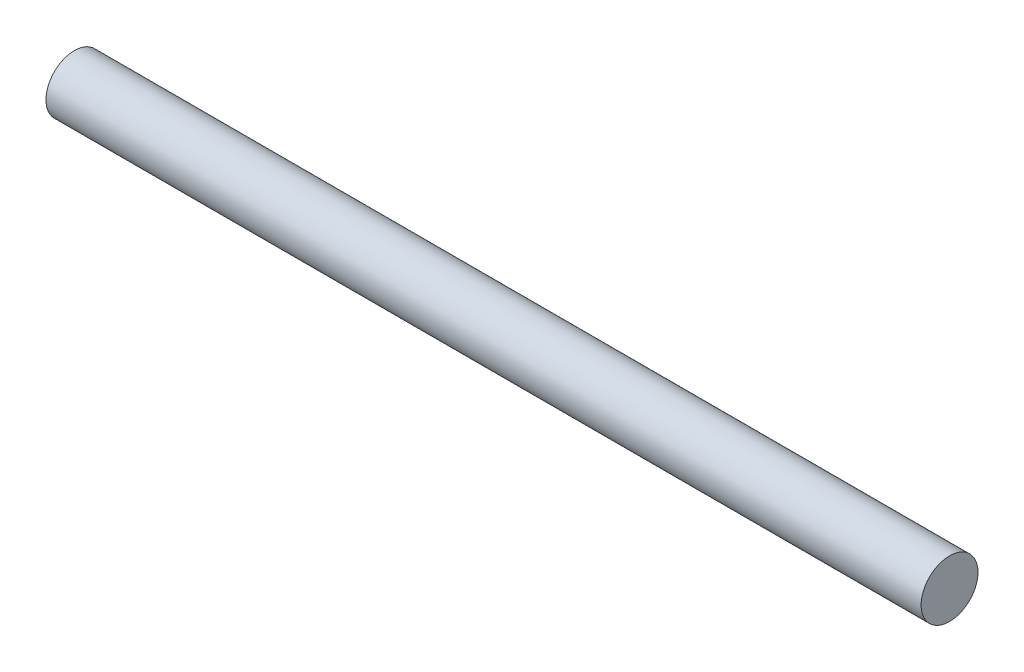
ISO-10303-21;
HEADER;
FILE_DESCRIPTION(('STEP AP214'),'2;1');
FILE_NAME('part.step','',(''),(''),'','','');
FILE_SCHEMA(('AUTOMOTIVE_DESIGN { 1 0 10303 214 1 1 1 1 }'));
ENDSEC;
DATA;
#1=APPLICATION_CONTEXT('core data for automotive mechanical design processes');
#2=APPLICATION_PROTOCOL_DEFINITION('international standard','automotive_design',2000,#1);
#3=PRODUCT_CONTEXT('',#1,'mechanical');
#4=PRODUCT('Part','Part','',(#3));
#5=PRODUCT_RELATED_PRODUCT_CATEGORY('part','',(#4));
#6=PRODUCT_DEFINITION_FORMATION('','',#4);
#7=PRODUCT_DEFINITION_CONTEXT('part definition',#1,'design');
#8=PRODUCT_DEFINITION('design','',#6,#7);
#9=PRODUCT_DEFINITION_SHAPE('','',#8);
#10=(LENGTH_UNIT() NAMED_UNIT(*) SI_UNIT(.MILLI.,.METRE.));
#11=(NAMED_UNIT(*) PLANE_ANGLE_UNIT() SI_UNIT($,.RADIAN.));
#12=(NAMED_UNIT(*) SI_UNIT($,.STERADIAN.) SOLID_ANGLE_UNIT());
#13=UNCERTAINTY_MEASURE_WITH_UNIT(LENGTH_MEASURE(1.E-05),#10,'distance_accuracy_value','');
#14=(GEOMETRIC_REPRESENTATION_CONTEXT(3) GLOBAL_UNCERTAINTY_ASSIGNED_CONTEXT((#13)) GLOBAL_UNIT_ASSIGNED_CONTEXT((#10,
#11,#12)) REPRESENTATION_CONTEXT('',''));
#15=CARTESIAN_POINT('',(0.,0.,0.));
#16=DIRECTION('',(0.,0.,1.));
#17=DIRECTION('',(1.,0.,0.));
#18=AXIS2_PLACEMENT_3D('',#15,#16,#17);
#19=CARTESIAN_POINT('',(50.8,0.,0.));
#20=DIRECTION('',(-1.,0.,0.));
#21=DIRECTION('',(0.,0.,1.));
#22=AXIS2_PLACEMENT_3D('',#19,#20,#21);
#23=CYLINDRICAL_SURFACE('',#22,1.651);
#24=CARTESIAN_POINT('',(50.8,0.,0.));
#25=DIRECTION('',(1.,0.,0.));
#26=DIRECTION('',(0.,0.,-1.));
#27=AXIS2_PLACEMENT_3D('',#24,#25,#26);
#28=CIRCLE('',#27,1.651);
#29=CARTESIAN_POINT('',(50.8,0.,-1.651));
#30=VERTEX_POINT('',#29);
#31=EDGE_CURVE('E10',#30,#30,#28,.T.);
#32=ORIENTED_EDGE('',*,*,#31,.F.);
#33=EDGE_LOOP('',(#32));
#34=FACE_BOUND('',#33,.T.);
#35=CARTESIAN_POINT('',(0.,0.,0.));
#36=DIRECTION('',(1.,0.,0.));
#37=DIRECTION('',(0.,0.,-1.));
#38=AXIS2_PLACEMENT_3D('',#35,#36,#37);
#39=CIRCLE('',#38,1.651);
#40=CARTESIAN_POINT('',(0.,0.,-1.651));
#41=VERTEX_POINT('',#40);
#42=EDGE_CURVE('E34',#41,#41,#39,.T.);
#43=ORIENTED_EDGE('',*,*,#42,.T.);
#44=EDGE_LOOP('',(#43));
#45=FACE_BOUND('',#44,.T.);
#46=ADVANCED_FACE('F31',(#34,#45),#23,.T.);
#47=CARTESIAN_POINT('',(50.8,0.,0.));
#48=DIRECTION('',(1.,0.,0.));
#49=DIRECTION('',(0.,0.,-1.));
#50=AXIS2_PLACEMENT_3D('',#47,#48,#49);
#51=PLANE('',#50);
#52=ORIENTED_EDGE('',*,*,#31,.T.);
#53=EDGE_LOOP('',(#52));
#54=FACE_BOUND('',#53,.T.);
#55=ADVANCED_FACE('F46',(#54),#51,.T.);
#56=CARTESIAN_POINT('',(0.,0.,0.));
#57=DIRECTION('',(1.,0.,0.));
#58=DIRECTION('',(0.,0.,-1.));
#59=AXIS2_PLACEMENT_3D('',#56,#57,#58);
#60=PLANE('',#59);
#61=ORIENTED_EDGE('',*,*,#42,.F.);
#62=EDGE_LOOP('',(#61));
#63=FACE_BOUND('',#62,.T.);
#64=ADVANCED_FACE('F44',(#63),#60,.F.);
#65=CLOSED_SHELL('',(#46,#55,#64));
#66=MANIFOLD_SOLID_BREP('B2',#65);
#67=ADVANCED_BREP_SHAPE_REPRESENTATION('',(#18,#66),#14);
#68=SHAPE_DEFINITION_REPRESENTATION(#9,#67);
ENDSEC;
END-ISO-10303-21;
